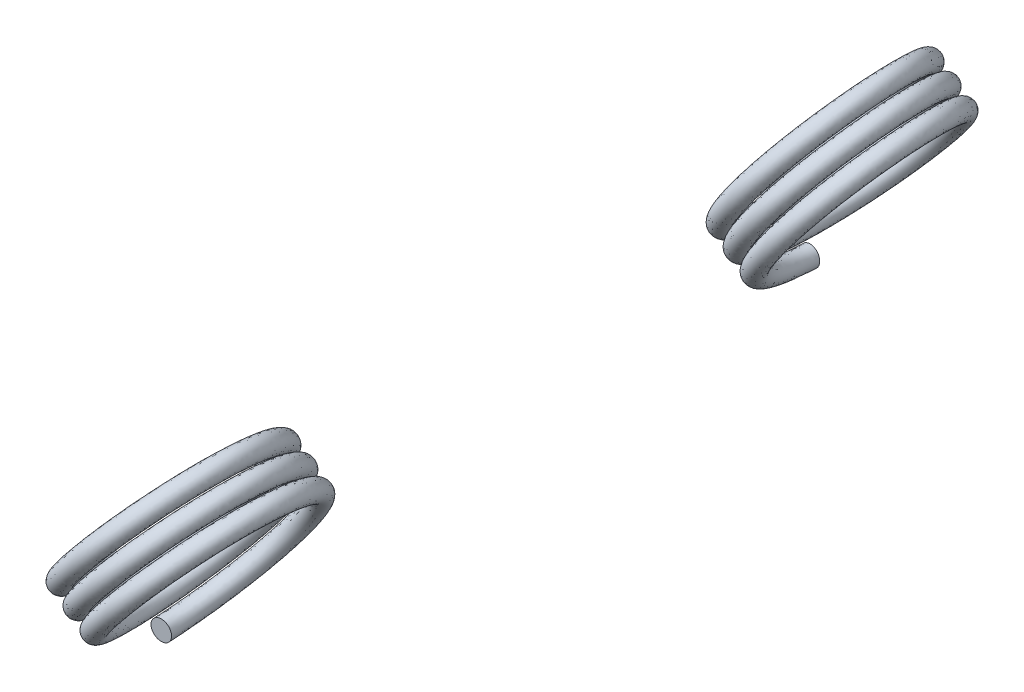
from build123d import *

# Parameters (mm, degrees)
MUELLE_IZQ_PITCH      = 1.7
MUELLE_IZQ_HEIGHT     = 5.1
MUELLE_IZQ_RADIUS     = 7.5
MUELLE_IZQ_PROFILE_R  = 0.8
MUELLE_DCHO_PITCH     = 1.7
MUELLE_DCHO_HEIGHT    = 5.1
MUELLE_DCHO_RADIUS    = 7.5
MUELLE_DCHO_PROFILE_R = 0.8


with BuildPart() as part:
    # Muelle_izq: sweep along a helix
    with BuildLine() as muelle_izq_path:
        Helix(MUELLE_IZQ_PITCH, MUELLE_IZQ_HEIGHT, MUELLE_IZQ_RADIUS, center=(-234.166024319, 351.036527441, -26), direction=(-0.8006542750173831, 0.5991266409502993, 0))
    # Muelle_izq profile (on start of the path) → Muelle_izq (sweep)
    with BuildSketch(Plane(origin=(-238.659474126, 345.031620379, -26), x_dir=(0.9995831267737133, 0, 0.028871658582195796), z_dir=(-0.028864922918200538, 0.021599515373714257, 0.9993499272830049))):
        Circle(MUELLE_IZQ_PROFILE_R)
    sweep(path=muelle_izq_path.line, is_frenet=True)


with BuildPart() as body_2:
    # Muelle_dcho: sweep along a helix
    with BuildLine() as muelle_dcho_path:
        Helix(MUELLE_DCHO_PITCH, MUELLE_DCHO_HEIGHT, MUELLE_DCHO_RADIUS, center=(-234.166024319, 351.036527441, 26), direction=(-0.8006542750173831, 0.5991266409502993, 0), lefthand=True)
    # Muelle_dcho profile (on start of the path) → Muelle_dcho (sweep)
    with BuildSketch(Plane(origin=(-238.659474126, 345.031620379, 26), x_dir=(-0.9995831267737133, 0, 0.028871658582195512), z_dir=(-0.028864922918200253, 0.021599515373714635, -0.9993499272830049))):
        Circle(MUELLE_DCHO_PROFILE_R)
    sweep(path=muelle_dcho_path.line, is_frenet=True)


solid = Compound([part.part, body_2.part])
